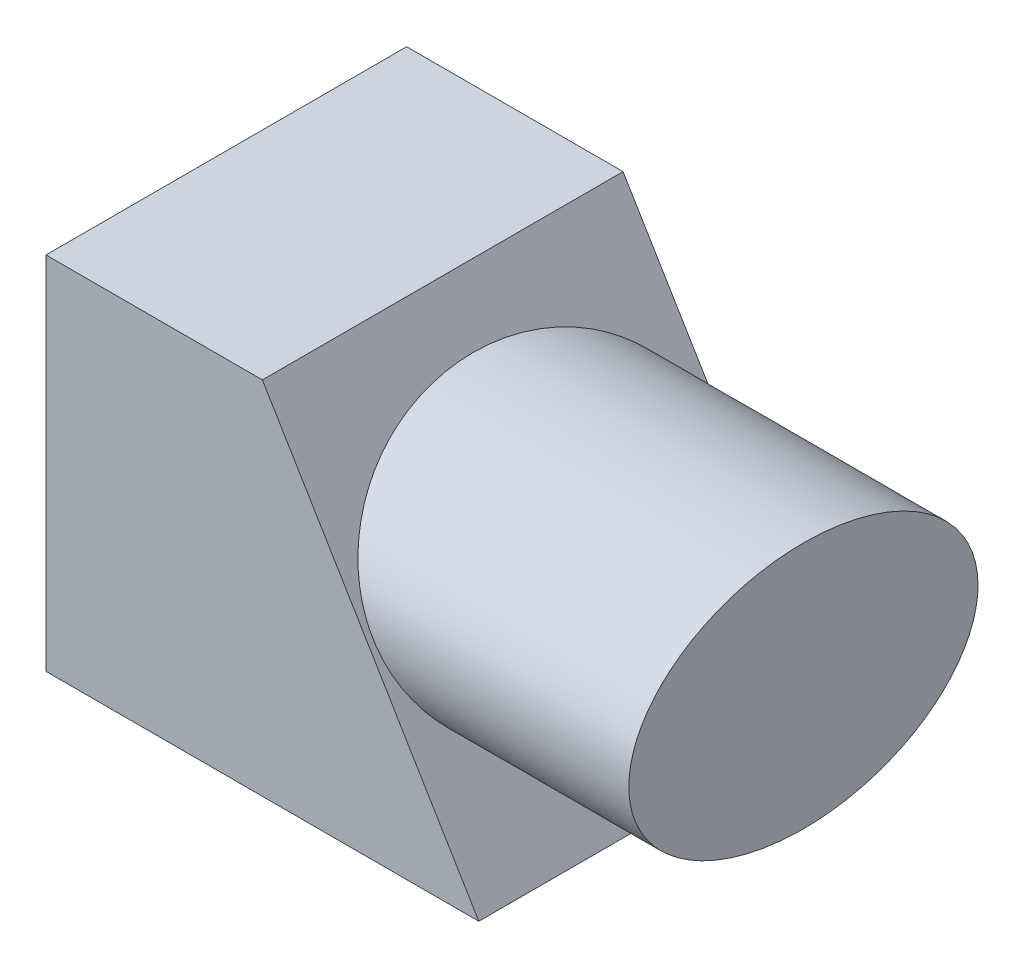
from build123d import *

# Parameters (mm, degrees)
EXTRUDE2_DEPTH = 25
EXTRUDE3_REACH = 99.596
SKETCH4_RX     = 24.203349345
SKETCH4_RY     = 17.167724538


with BuildPart() as part:
    # Sketch2 → Extrude2 (new, symmetric)
    with BuildSketch(Plane.XY):
        Polygon((0, 0), (60, 0), (30, 50), (0, 50), align=None)
    extrude(amount=EXTRUDE2_DEPTH, both=True)

    # Extrude3: up to this plane
    extrude3_end = Plane(origin=(60, 0, 25), z_dir=(-0.8574929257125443, -0.5144957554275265, 0))
    # Sketch4 → Extrude3 (add, up to the surface)
    with BuildSketch(Plane(origin=(80, 0, 0), x_dir=(0, 0, -1), z_dir=(1, 0, 0)), mode=Mode.PRIVATE) as extrude3_sk1:
        with Locations((0, 25.757933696)):
            Ellipse(SKETCH4_RX, SKETCH4_RY)
    extrude3_tool1 = split(extrude(extrude3_sk1.sketch, amount=-EXTRUDE3_REACH, mode=Mode.PRIVATE), bisect_by=extrude3_end, keep=Keep.BOTH, mode=Mode.PRIVATE)
    add(extrude3_tool1.solids().sort_by_distance((80, 25.757934, 0))[0])


solid = part.part
